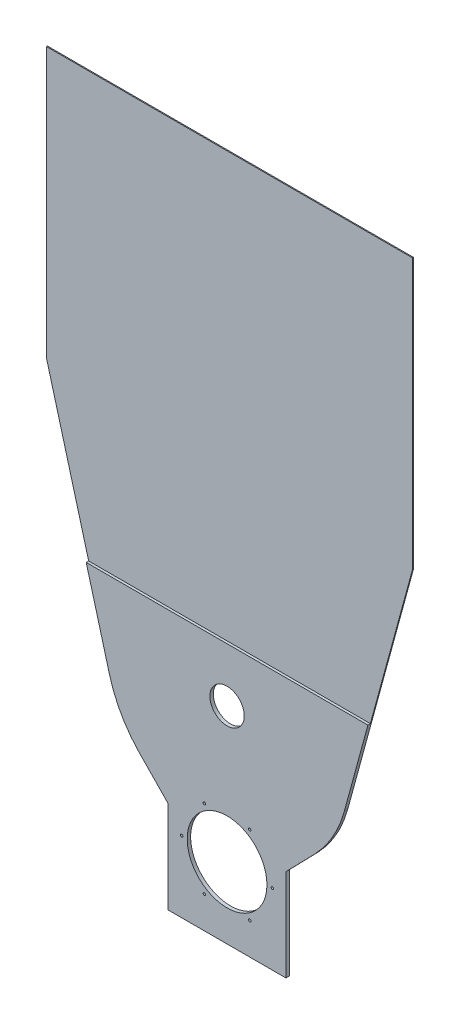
ISO-10303-21;
HEADER;
FILE_DESCRIPTION(('STEP AP214'),'2;1');
FILE_NAME('part.step','',(''),(''),'','','');
FILE_SCHEMA(('AUTOMOTIVE_DESIGN { 1 0 10303 214 1 1 1 1 }'));
ENDSEC;
DATA;
#1=APPLICATION_CONTEXT('core data for automotive mechanical design processes');
#2=APPLICATION_PROTOCOL_DEFINITION('international standard','automotive_design',2000,#1);
#3=PRODUCT_CONTEXT('',#1,'mechanical');
#4=PRODUCT('Part','Part','',(#3));
#5=PRODUCT_RELATED_PRODUCT_CATEGORY('part','',(#4));
#6=PRODUCT_DEFINITION_FORMATION('','',#4);
#7=PRODUCT_DEFINITION_CONTEXT('part definition',#1,'design');
#8=PRODUCT_DEFINITION('design','',#6,#7);
#9=PRODUCT_DEFINITION_SHAPE('','',#8);
#10=(LENGTH_UNIT() NAMED_UNIT(*) SI_UNIT(.MILLI.,.METRE.));
#11=(NAMED_UNIT(*) PLANE_ANGLE_UNIT() SI_UNIT($,.RADIAN.));
#12=(NAMED_UNIT(*) SI_UNIT($,.STERADIAN.) SOLID_ANGLE_UNIT());
#13=UNCERTAINTY_MEASURE_WITH_UNIT(LENGTH_MEASURE(1.E-05),#10,'distance_accuracy_value','');
#14=(GEOMETRIC_REPRESENTATION_CONTEXT(3) GLOBAL_UNCERTAINTY_ASSIGNED_CONTEXT((#13)) GLOBAL_UNIT_ASSIGNED_CONTEXT((#10,
#11,#12)) REPRESENTATION_CONTEXT('',''));
#15=CARTESIAN_POINT('',(0.,0.,0.));
#16=DIRECTION('',(0.,0.,1.));
#17=DIRECTION('',(1.,0.,0.));
#18=AXIS2_PLACEMENT_3D('',#15,#16,#17);
#19=CARTESIAN_POINT('',(0.,550.,14.));
#20=DIRECTION('',(0.,0.,1.));
#21=DIRECTION('',(1.,0.,0.));
#22=AXIS2_PLACEMENT_3D('',#19,#20,#21);
#23=PLANE('',#22);
#24=CARTESIAN_POINT('',(92.4999999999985,-160.214699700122,14.));
#25=DIRECTION('',(0.,0.,-1.));
#26=DIRECTION('',(-1.,0.,0.));
#27=AXIS2_PLACEMENT_3D('',#24,#25,#26);
#28=CIRCLE('',#27,5.09999999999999);
#29=CARTESIAN_POINT('',(87.3999999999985,-160.214699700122,14.));
#30=VERTEX_POINT('',#29);
#31=EDGE_CURVE('E269',#30,#30,#28,.T.);
#32=ORIENTED_EDGE('',*,*,#31,.T.);
#33=EDGE_LOOP('',(#32));
#34=FACE_BOUND('',#33,.T.);
#35=CARTESIAN_POINT('',(92.5000000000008,160.214699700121,14.));
#36=DIRECTION('',(0.,0.,-1.));
#37=DIRECTION('',(-1.,0.,0.));
#38=AXIS2_PLACEMENT_3D('',#35,#36,#37);
#39=CIRCLE('',#38,5.09999999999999);
#40=CARTESIAN_POINT('',(87.4000000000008,160.214699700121,14.));
#41=VERTEX_POINT('',#40);
#42=EDGE_CURVE('E257',#41,#41,#39,.T.);
#43=ORIENTED_EDGE('',*,*,#42,.T.);
#44=EDGE_LOOP('',(#43));
#45=FACE_BOUND('',#44,.T.);
#46=CARTESIAN_POINT('',(0.,550.,14.));
#47=DIRECTION('',(0.,0.,1.));
#48=DIRECTION('',(1.,0.,0.));
#49=AXIS2_PLACEMENT_3D('',#46,#47,#48);
#50=CIRCLE('',#49,70.);
#51=CARTESIAN_POINT('',(70.,550.,14.));
#52=VERTEX_POINT('',#51);
#53=EDGE_CURVE('E237',#52,#52,#50,.T.);
#54=ORIENTED_EDGE('',*,*,#53,.F.);
#55=EDGE_LOOP('',(#54));
#56=FACE_BOUND('',#55,.T.);
#57=CARTESIAN_POINT('',(0.,0.,14.));
#58=DIRECTION('',(0.,0.,1.));
#59=DIRECTION('',(1.,0.,0.));
#60=AXIS2_PLACEMENT_3D('',#57,#58,#59);
#61=CIRCLE('',#60,162.5);
#62=CARTESIAN_POINT('',(162.5,0.,14.));
#63=VERTEX_POINT('',#62);
#64=EDGE_CURVE('E161',#63,#63,#61,.T.);
#65=ORIENTED_EDGE('',*,*,#64,.F.);
#66=EDGE_LOOP('',(#65));
#67=FACE_BOUND('',#66,.T.);
#68=CARTESIAN_POINT('',(-185.,0.,14.));
#69=DIRECTION('',(0.,0.,-1.));
#70=DIRECTION('',(-1.,0.,0.));
#71=AXIS2_PLACEMENT_3D('',#68,#69,#70);
#72=CIRCLE('',#71,5.09999999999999);
#73=CARTESIAN_POINT('',(-190.1,0.,14.));
#74=VERTEX_POINT('',#73);
#75=EDGE_CURVE('E243',#74,#74,#72,.T.);
#76=ORIENTED_EDGE('',*,*,#75,.T.);
#77=EDGE_LOOP('',(#76));
#78=FACE_BOUND('',#77,.T.);
#79=CARTESIAN_POINT('',(-92.4999999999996,160.214699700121,14.));
#80=DIRECTION('',(0.,0.,-1.));
#81=DIRECTION('',(-1.,0.,0.));
#82=AXIS2_PLACEMENT_3D('',#79,#80,#81);
#83=CIRCLE('',#82,5.09999999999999);
#84=CARTESIAN_POINT('',(-97.5999999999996,160.214699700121,14.));
#85=VERTEX_POINT('',#84);
#86=EDGE_CURVE('E251',#85,#85,#83,.T.);
#87=ORIENTED_EDGE('',*,*,#86,.T.);
#88=EDGE_LOOP('',(#87));
#89=FACE_BOUND('',#88,.T.);
#90=CARTESIAN_POINT('',(185.,0.,14.));
#91=DIRECTION('',(0.,0.,-1.));
#92=DIRECTION('',(-1.,0.,0.));
#93=AXIS2_PLACEMENT_3D('',#90,#91,#92);
#94=CIRCLE('',#93,5.09999999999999);
#95=CARTESIAN_POINT('',(179.9,0.,14.));
#96=VERTEX_POINT('',#95);
#97=EDGE_CURVE('E263',#96,#96,#94,.T.);
#98=ORIENTED_EDGE('',*,*,#97,.T.);
#99=EDGE_LOOP('',(#98));
#100=FACE_BOUND('',#99,.T.);
#101=CARTESIAN_POINT('',(-92.5000000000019,-160.21469970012,14.));
#102=DIRECTION('',(0.,0.,-1.));
#103=DIRECTION('',(-1.,0.,0.));
#104=AXIS2_PLACEMENT_3D('',#101,#102,#103);
#105=CIRCLE('',#104,5.09999999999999);
#106=CARTESIAN_POINT('',(-97.6000000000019,-160.21469970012,14.));
#107=VERTEX_POINT('',#106);
#108=EDGE_CURVE('E275',#107,#107,#105,.T.);
#109=ORIENTED_EDGE('',*,*,#108,.T.);
#110=EDGE_LOOP('',(#109));
#111=FACE_BOUND('',#110,.T.);
#112=DIRECTION('',(0.263178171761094,0.964747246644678,0.));
#113=VECTOR('',#112,1.);
#114=CARTESIAN_POINT('',(746.,1400.,14.));
#115=LINE('',#114,#113);
#116=CARTESIAN_POINT('',(478.514634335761,419.463626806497,14.));
#117=VERTEX_POINT('',#116);
#118=CARTESIAN_POINT('',(574.139184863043,770.,14.));
#119=VERTEX_POINT('',#118);
#120=EDGE_CURVE('E139',#117,#119,#115,.T.);
#121=ORIENTED_EDGE('',*,*,#120,.T.);
#122=DIRECTION('',(-1.,0.,0.));
#123=VECTOR('',#122,1.);
#124=CARTESIAN_POINT('',(574.139184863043,770.,14.));
#125=LINE('',#124,#123);
#126=CARTESIAN_POINT('',(-574.139184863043,770.,14.));
#127=VERTEX_POINT('',#126);
#128=EDGE_CURVE('E136',#119,#127,#125,.T.);
#129=ORIENTED_EDGE('',*,*,#128,.T.);
#130=DIRECTION('',(0.263178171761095,-0.964747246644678,0.));
#131=VECTOR('',#130,1.);
#132=CARTESIAN_POINT('',(-746.000000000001,1400.,14.));
#133=LINE('',#132,#131);
#134=CARTESIAN_POINT('',(-478.514634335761,419.463626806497,14.));
#135=VERTEX_POINT('',#134);
#136=EDGE_CURVE('E129',#127,#135,#133,.T.);
#137=ORIENTED_EDGE('',*,*,#136,.T.);
#138=CARTESIAN_POINT('',(0.,550.,14.));
#139=DIRECTION('',(0.,0.,1.));
#140=DIRECTION('',(1.,0.,0.));
#141=AXIS2_PLACEMENT_3D('',#138,#139,#140);
#142=CIRCLE('',#141,496.);
#143=CARTESIAN_POINT('',(-359.378262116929,208.147305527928,14.));
#144=VERTEX_POINT('',#143);
#145=EDGE_CURVE('E133',#135,#144,#142,.T.);
#146=ORIENTED_EDGE('',*,*,#145,.T.);
#147=DIRECTION('',(0.697242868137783,-0.716834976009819,0.));
#148=VECTOR('',#147,1.);
#149=CARTESIAN_POINT('',(-240.,85.4145855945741,14.));
#150=LINE('',#149,#148);
#151=CARTESIAN_POINT('',(-240.,85.4145855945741,14.));
#152=VERTEX_POINT('',#151);
#153=EDGE_CURVE('E59',#144,#152,#150,.T.);
#154=ORIENTED_EDGE('',*,*,#153,.T.);
#155=DIRECTION('',(0.,-1.,0.));
#156=VECTOR('',#155,1.);
#157=CARTESIAN_POINT('',(-240.,-290.,14.));
#158=LINE('',#157,#156);
#159=CARTESIAN_POINT('',(-240.,-290.,14.));
#160=VERTEX_POINT('',#159);
#161=EDGE_CURVE('E185',#152,#160,#158,.T.);
#162=ORIENTED_EDGE('',*,*,#161,.T.);
#163=DIRECTION('',(1.,0.,0.));
#164=VECTOR('',#163,1.);
#165=CARTESIAN_POINT('',(-240.,-290.,14.));
#166=LINE('',#165,#164);
#167=CARTESIAN_POINT('',(240.,-290.,14.));
#168=VERTEX_POINT('',#167);
#169=EDGE_CURVE('E112',#160,#168,#166,.T.);
#170=ORIENTED_EDGE('',*,*,#169,.T.);
#171=DIRECTION('',(0.,1.,0.));
#172=VECTOR('',#171,1.);
#173=CARTESIAN_POINT('',(240.,-290.,14.));
#174=LINE('',#173,#172);
#175=CARTESIAN_POINT('',(240.,85.4145855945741,14.));
#176=VERTEX_POINT('',#175);
#177=EDGE_CURVE('E209',#168,#176,#174,.T.);
#178=ORIENTED_EDGE('',*,*,#177,.T.);
#179=DIRECTION('',(0.697242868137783,0.716834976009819,0.));
#180=VECTOR('',#179,1.);
#181=CARTESIAN_POINT('',(240.,85.4145855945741,14.));
#182=LINE('',#181,#180);
#183=CARTESIAN_POINT('',(359.378262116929,208.147305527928,14.));
#184=VERTEX_POINT('',#183);
#185=EDGE_CURVE('E227',#176,#184,#182,.T.);
#186=ORIENTED_EDGE('',*,*,#185,.T.);
#187=CARTESIAN_POINT('',(0.,550.,14.));
#188=DIRECTION('',(0.,0.,1.));
#189=DIRECTION('',(-1.,0.,0.));
#190=AXIS2_PLACEMENT_3D('',#187,#188,#189);
#191=CIRCLE('',#190,496.);
#192=EDGE_CURVE('E225',#184,#117,#191,.T.);
#193=ORIENTED_EDGE('',*,*,#192,.T.);
#194=EDGE_LOOP('',(#121,#129,#137,#146,#154,#162,#170,#178,#186,#193));
#195=FACE_BOUND('',#194,.T.);
#196=ADVANCED_FACE('F35',(#34,#45,#56,#67,#78,#89,#100,#111,#195),#23,.T.);
#197=CARTESIAN_POINT('',(746.,1400.,14.));
#198=DIRECTION('',(-0.964747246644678,0.263178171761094,0.));
#199=DIRECTION('',(-0.263178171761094,-0.964747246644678,0.));
#200=AXIS2_PLACEMENT_3D('',#197,#198,#199);
#201=PLANE('',#200);
#202=DIRECTION('',(0.,0.,1.));
#203=VECTOR('',#202,1.);
#204=CARTESIAN_POINT('',(574.139184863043,770.,4.));
#205=LINE('',#204,#203);
#206=CARTESIAN_POINT('',(574.139184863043,770.,4.));
#207=VERTEX_POINT('',#206);
#208=EDGE_CURVE('E281',#207,#119,#205,.T.);
#209=ORIENTED_EDGE('',*,*,#208,.T.);
#210=ORIENTED_EDGE('',*,*,#120,.F.);
#211=DIRECTION('',(0.,0.,-1.));
#212=VECTOR('',#211,1.);
#213=CARTESIAN_POINT('',(478.514634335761,419.463626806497,14.));
#214=LINE('',#213,#212);
#215=CARTESIAN_POINT('',(478.514634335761,419.463626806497,0.));
#216=VERTEX_POINT('',#215);
#217=EDGE_CURVE('E195',#117,#216,#214,.T.);
#218=ORIENTED_EDGE('',*,*,#217,.T.);
#219=DIRECTION('',(0.263178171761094,0.964747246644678,0.));
#220=VECTOR('',#219,1.);
#221=CARTESIAN_POINT('',(746.,1400.,0.));
#222=LINE('',#221,#220);
#223=CARTESIAN_POINT('',(746.,1400.,0.));
#224=VERTEX_POINT('',#223);
#225=EDGE_CURVE('E169',#216,#224,#222,.T.);
#226=ORIENTED_EDGE('',*,*,#225,.T.);
#227=DIRECTION('',(0.,0.,-1.));
#228=VECTOR('',#227,1.);
#229=CARTESIAN_POINT('',(746.,1400.,14.));
#230=LINE('',#229,#228);
#231=CARTESIAN_POINT('',(746.,1400.,4.));
#232=VERTEX_POINT('',#231);
#233=EDGE_CURVE('E193',#232,#224,#230,.T.);
#234=ORIENTED_EDGE('',*,*,#233,.F.);
#235=DIRECTION('',(-0.263178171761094,-0.964747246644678,0.));
#236=VECTOR('',#235,1.);
#237=CARTESIAN_POINT('',(574.139184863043,770.,4.));
#238=LINE('',#237,#236);
#239=EDGE_CURVE('E298',#232,#207,#238,.T.);
#240=ORIENTED_EDGE('',*,*,#239,.T.);
#241=EDGE_LOOP('',(#209,#210,#218,#226,#234,#240));
#242=FACE_BOUND('',#241,.T.);
#243=ADVANCED_FACE('F312',(#242),#201,.F.);
#244=CARTESIAN_POINT('',(746.,2500.,14.));
#245=DIRECTION('',(-1.,0.,0.));
#246=DIRECTION('',(0.,0.,1.));
#247=AXIS2_PLACEMENT_3D('',#244,#245,#246);
#248=PLANE('',#247);
#249=DIRECTION('',(0.,-1.,0.));
#250=VECTOR('',#249,1.);
#251=CARTESIAN_POINT('',(746.,1400.,4.));
#252=LINE('',#251,#250);
#253=CARTESIAN_POINT('',(746.,2500.,4.));
#254=VERTEX_POINT('',#253);
#255=EDGE_CURVE('E289',#254,#232,#252,.T.);
#256=ORIENTED_EDGE('',*,*,#255,.T.);
#257=ORIENTED_EDGE('',*,*,#233,.T.);
#258=DIRECTION('',(0.,1.,0.));
#259=VECTOR('',#258,1.);
#260=CARTESIAN_POINT('',(746.,2500.,0.));
#261=LINE('',#260,#259);
#262=CARTESIAN_POINT('',(746.,2500.,0.));
#263=VERTEX_POINT('',#262);
#264=EDGE_CURVE('E172',#224,#263,#261,.T.);
#265=ORIENTED_EDGE('',*,*,#264,.T.);
#266=DIRECTION('',(0.,0.,-1.));
#267=VECTOR('',#266,1.);
#268=CARTESIAN_POINT('',(746.,2500.,14.));
#269=LINE('',#268,#267);
#270=EDGE_CURVE('E191',#254,#263,#269,.T.);
#271=ORIENTED_EDGE('',*,*,#270,.F.);
#272=EDGE_LOOP('',(#256,#257,#265,#271));
#273=FACE_BOUND('',#272,.T.);
#274=ADVANCED_FACE('F307',(#273),#248,.F.);
#275=CARTESIAN_POINT('',(-746.,2500.,14.));
#276=DIRECTION('',(0.,-1.,0.));
#277=DIRECTION('',(0.,0.,-1.));
#278=AXIS2_PLACEMENT_3D('',#275,#276,#277);
#279=PLANE('',#278);
#280=DIRECTION('',(1.,0.,0.));
#281=VECTOR('',#280,1.);
#282=CARTESIAN_POINT('',(746.,2500.,4.));
#283=LINE('',#282,#281);
#284=CARTESIAN_POINT('',(-746.,2500.,4.));
#285=VERTEX_POINT('',#284);
#286=EDGE_CURVE('E287',#285,#254,#283,.T.);
#287=ORIENTED_EDGE('',*,*,#286,.T.);
#288=ORIENTED_EDGE('',*,*,#270,.T.);
#289=DIRECTION('',(-1.,0.,0.));
#290=VECTOR('',#289,1.);
#291=CARTESIAN_POINT('',(-746.,2500.,0.));
#292=LINE('',#291,#290);
#293=CARTESIAN_POINT('',(-746.,2500.,0.));
#294=VERTEX_POINT('',#293);
#295=EDGE_CURVE('E175',#263,#294,#292,.T.);
#296=ORIENTED_EDGE('',*,*,#295,.T.);
#297=DIRECTION('',(0.,0.,-1.));
#298=VECTOR('',#297,1.);
#299=CARTESIAN_POINT('',(-746.,2500.,14.));
#300=LINE('',#299,#298);
#301=EDGE_CURVE('E189',#285,#294,#300,.T.);
#302=ORIENTED_EDGE('',*,*,#301,.F.);
#303=EDGE_LOOP('',(#287,#288,#296,#302));
#304=FACE_BOUND('',#303,.T.);
#305=ADVANCED_FACE('F318',(#304),#279,.F.);
#306=CARTESIAN_POINT('',(-746.000000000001,1400.,14.));
#307=DIRECTION('',(1.,0.,0.));
#308=DIRECTION('',(0.,1.,0.));
#309=AXIS2_PLACEMENT_3D('',#306,#307,#308);
#310=PLANE('',#309);
#311=DIRECTION('',(0.,1.,0.));
#312=VECTOR('',#311,1.);
#313=CARTESIAN_POINT('',(-746.,2500.,4.));
#314=LINE('',#313,#312);
#315=CARTESIAN_POINT('',(-746.000000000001,1400.,4.));
#316=VERTEX_POINT('',#315);
#317=EDGE_CURVE('E50',#316,#285,#314,.T.);
#318=ORIENTED_EDGE('',*,*,#317,.T.);
#319=ORIENTED_EDGE('',*,*,#301,.T.);
#320=DIRECTION('',(0.,-1.,0.));
#321=VECTOR('',#320,1.);
#322=CARTESIAN_POINT('',(-746.000000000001,1400.,0.));
#323=LINE('',#322,#321);
#324=CARTESIAN_POINT('',(-746.000000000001,1400.,0.));
#325=VERTEX_POINT('',#324);
#326=EDGE_CURVE('E178',#294,#325,#323,.T.);
#327=ORIENTED_EDGE('',*,*,#326,.T.);
#328=DIRECTION('',(0.,0.,-1.));
#329=VECTOR('',#328,1.);
#330=CARTESIAN_POINT('',(-746.000000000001,1400.,14.));
#331=LINE('',#330,#329);
#332=EDGE_CURVE('E148',#316,#325,#331,.T.);
#333=ORIENTED_EDGE('',*,*,#332,.F.);
#334=EDGE_LOOP('',(#318,#319,#327,#333));
#335=FACE_BOUND('',#334,.T.);
#336=ADVANCED_FACE('F326',(#335),#310,.F.);
#337=CARTESIAN_POINT('',(-746.000000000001,1400.,14.));
#338=DIRECTION('',(0.964747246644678,0.263178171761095,0.));
#339=DIRECTION('',(-0.263178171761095,0.964747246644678,0.));
#340=AXIS2_PLACEMENT_3D('',#337,#338,#339);
#341=PLANE('',#340);
#342=DIRECTION('',(0.,0.,1.));
#343=VECTOR('',#342,1.);
#344=CARTESIAN_POINT('',(-574.139184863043,770.,4.));
#345=LINE('',#344,#343);
#346=CARTESIAN_POINT('',(-574.139184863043,770.,4.));
#347=VERTEX_POINT('',#346);
#348=EDGE_CURVE('E284',#347,#127,#345,.T.);
#349=ORIENTED_EDGE('',*,*,#348,.F.);
#350=DIRECTION('',(-0.263178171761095,0.964747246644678,0.));
#351=VECTOR('',#350,1.);
#352=CARTESIAN_POINT('',(-746.000000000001,1400.,4.));
#353=LINE('',#352,#351);
#354=EDGE_CURVE('E293',#347,#316,#353,.T.);
#355=ORIENTED_EDGE('',*,*,#354,.T.);
#356=ORIENTED_EDGE('',*,*,#332,.T.);
#357=DIRECTION('',(0.263178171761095,-0.964747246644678,0.));
#358=VECTOR('',#357,1.);
#359=CARTESIAN_POINT('',(-746.000000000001,1400.,0.));
#360=LINE('',#359,#358);
#361=CARTESIAN_POINT('',(-478.514634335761,419.463626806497,0.));
#362=VERTEX_POINT('',#361);
#363=EDGE_CURVE('E145',#325,#362,#360,.T.);
#364=ORIENTED_EDGE('',*,*,#363,.T.);
#365=DIRECTION('',(0.,0.,-1.));
#366=VECTOR('',#365,1.);
#367=CARTESIAN_POINT('',(-478.514634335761,419.463626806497,14.));
#368=LINE('',#367,#366);
#369=EDGE_CURVE('E142',#135,#362,#368,.T.);
#370=ORIENTED_EDGE('',*,*,#369,.F.);
#371=ORIENTED_EDGE('',*,*,#136,.F.);
#372=EDGE_LOOP('',(#349,#355,#356,#364,#370,#371));
#373=FACE_BOUND('',#372,.T.);
#374=ADVANCED_FACE('F143',(#373),#341,.F.);
#375=CARTESIAN_POINT('',(0.,550.,0.));
#376=DIRECTION('',(0.,0.,1.));
#377=DIRECTION('',(1.,0.,0.));
#378=AXIS2_PLACEMENT_3D('',#375,#376,#377);
#379=PLANE('',#378);
#380=CARTESIAN_POINT('',(-185.,0.,0.));
#381=DIRECTION('',(0.,0.,-1.));
#382=DIRECTION('',(-1.,0.,0.));
#383=AXIS2_PLACEMENT_3D('',#380,#381,#382);
#384=CIRCLE('',#383,5.09999999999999);
#385=CARTESIAN_POINT('',(-190.1,0.,0.));
#386=VERTEX_POINT('',#385);
#387=EDGE_CURVE('E248',#386,#386,#384,.T.);
#388=ORIENTED_EDGE('',*,*,#387,.F.);
#389=EDGE_LOOP('',(#388));
#390=FACE_BOUND('',#389,.T.);
#391=DIRECTION('',(0.,-1.,0.));
#392=VECTOR('',#391,1.);
#393=CARTESIAN_POINT('',(-240.,-290.,0.));
#394=LINE('',#393,#392);
#395=CARTESIAN_POINT('',(-240.,85.4145855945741,0.));
#396=VERTEX_POINT('',#395);
#397=CARTESIAN_POINT('',(-240.,-290.,0.));
#398=VERTEX_POINT('',#397);
#399=EDGE_CURVE('E157',#396,#398,#394,.T.);
#400=ORIENTED_EDGE('',*,*,#399,.F.);
#401=DIRECTION('',(0.697242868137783,-0.716834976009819,0.));
#402=VECTOR('',#401,1.);
#403=CARTESIAN_POINT('',(-240.,85.4145855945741,0.));
#404=LINE('',#403,#402);
#405=CARTESIAN_POINT('',(-359.378262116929,208.147305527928,0.));
#406=VERTEX_POINT('',#405);
#407=EDGE_CURVE('E104',#406,#396,#404,.T.);
#408=ORIENTED_EDGE('',*,*,#407,.F.);
#409=CARTESIAN_POINT('',(0.,550.,0.));
#410=DIRECTION('',(0.,0.,1.));
#411=DIRECTION('',(1.,0.,0.));
#412=AXIS2_PLACEMENT_3D('',#409,#410,#411);
#413=CIRCLE('',#412,496.);
#414=EDGE_CURVE('E182',#362,#406,#413,.T.);
#415=ORIENTED_EDGE('',*,*,#414,.F.);
#416=ORIENTED_EDGE('',*,*,#363,.F.);
#417=ORIENTED_EDGE('',*,*,#326,.F.);
#418=ORIENTED_EDGE('',*,*,#295,.F.);
#419=ORIENTED_EDGE('',*,*,#264,.F.);
#420=ORIENTED_EDGE('',*,*,#225,.F.);
#421=CARTESIAN_POINT('',(0.,550.,0.));
#422=DIRECTION('',(0.,0.,1.));
#423=DIRECTION('',(-1.,0.,0.));
#424=AXIS2_PLACEMENT_3D('',#421,#422,#423);
#425=CIRCLE('',#424,496.);
#426=CARTESIAN_POINT('',(359.378262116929,208.147305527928,0.));
#427=VERTEX_POINT('',#426);
#428=EDGE_CURVE('E167',#427,#216,#425,.T.);
#429=ORIENTED_EDGE('',*,*,#428,.F.);
#430=DIRECTION('',(0.697242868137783,0.716834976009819,0.));
#431=VECTOR('',#430,1.);
#432=CARTESIAN_POINT('',(240.,85.4145855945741,0.));
#433=LINE('',#432,#431);
#434=CARTESIAN_POINT('',(240.,85.4145855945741,0.));
#435=VERTEX_POINT('',#434);
#436=EDGE_CURVE('E165',#435,#427,#433,.T.);
#437=ORIENTED_EDGE('',*,*,#436,.F.);
#438=DIRECTION('',(0.,1.,0.));
#439=VECTOR('',#438,1.);
#440=CARTESIAN_POINT('',(240.,-290.,0.));
#441=LINE('',#440,#439);
#442=CARTESIAN_POINT('',(240.,-290.,0.));
#443=VERTEX_POINT('',#442);
#444=EDGE_CURVE('E163',#443,#435,#441,.T.);
#445=ORIENTED_EDGE('',*,*,#444,.F.);
#446=DIRECTION('',(1.,0.,0.));
#447=VECTOR('',#446,1.);
#448=CARTESIAN_POINT('',(-240.,-290.,0.));
#449=LINE('',#448,#447);
#450=EDGE_CURVE('E160',#398,#443,#449,.T.);
#451=ORIENTED_EDGE('',*,*,#450,.F.);
#452=EDGE_LOOP('',(#400,#408,#415,#416,#417,#418,#419,#420,#429,#437,#445,#451));
#453=FACE_BOUND('',#452,.T.);
#454=CARTESIAN_POINT('',(0.,0.,0.));
#455=DIRECTION('',(0.,0.,1.));
#456=DIRECTION('',(1.,0.,0.));
#457=AXIS2_PLACEMENT_3D('',#454,#455,#456);
#458=CIRCLE('',#457,162.5);
#459=CARTESIAN_POINT('',(162.5,0.,0.));
#460=VERTEX_POINT('',#459);
#461=EDGE_CURVE('E234',#460,#460,#458,.T.);
#462=ORIENTED_EDGE('',*,*,#461,.T.);
#463=EDGE_LOOP('',(#462));
#464=FACE_BOUND('',#463,.T.);
#465=CARTESIAN_POINT('',(0.,550.,0.));
#466=DIRECTION('',(0.,0.,1.));
#467=DIRECTION('',(1.,0.,0.));
#468=AXIS2_PLACEMENT_3D('',#465,#466,#467);
#469=CIRCLE('',#468,70.);
#470=CARTESIAN_POINT('',(70.,550.,0.));
#471=VERTEX_POINT('',#470);
#472=EDGE_CURVE('E240',#471,#471,#469,.T.);
#473=ORIENTED_EDGE('',*,*,#472,.T.);
#474=EDGE_LOOP('',(#473));
#475=FACE_BOUND('',#474,.T.);
#476=CARTESIAN_POINT('',(-92.4999999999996,160.214699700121,0.));
#477=DIRECTION('',(0.,0.,-1.));
#478=DIRECTION('',(-1.,0.,0.));
#479=AXIS2_PLACEMENT_3D('',#476,#477,#478);
#480=CIRCLE('',#479,5.09999999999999);
#481=CARTESIAN_POINT('',(-97.5999999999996,160.214699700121,0.));
#482=VERTEX_POINT('',#481);
#483=EDGE_CURVE('E254',#482,#482,#480,.T.);
#484=ORIENTED_EDGE('',*,*,#483,.F.);
#485=EDGE_LOOP('',(#484));
#486=FACE_BOUND('',#485,.T.);
#487=CARTESIAN_POINT('',(92.5000000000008,160.214699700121,0.));
#488=DIRECTION('',(0.,0.,-1.));
#489=DIRECTION('',(-1.,0.,0.));
#490=AXIS2_PLACEMENT_3D('',#487,#488,#489);
#491=CIRCLE('',#490,5.09999999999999);
#492=CARTESIAN_POINT('',(87.4000000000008,160.214699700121,0.));
#493=VERTEX_POINT('',#492);
#494=EDGE_CURVE('E260',#493,#493,#491,.T.);
#495=ORIENTED_EDGE('',*,*,#494,.F.);
#496=EDGE_LOOP('',(#495));
#497=FACE_BOUND('',#496,.T.);
#498=CARTESIAN_POINT('',(185.,0.,0.));
#499=DIRECTION('',(0.,0.,-1.));
#500=DIRECTION('',(-1.,0.,0.));
#501=AXIS2_PLACEMENT_3D('',#498,#499,#500);
#502=CIRCLE('',#501,5.09999999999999);
#503=CARTESIAN_POINT('',(179.9,0.,0.));
#504=VERTEX_POINT('',#503);
#505=EDGE_CURVE('E266',#504,#504,#502,.T.);
#506=ORIENTED_EDGE('',*,*,#505,.F.);
#507=EDGE_LOOP('',(#506));
#508=FACE_BOUND('',#507,.T.);
#509=CARTESIAN_POINT('',(92.4999999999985,-160.214699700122,0.));
#510=DIRECTION('',(0.,0.,-1.));
#511=DIRECTION('',(-1.,0.,0.));
#512=AXIS2_PLACEMENT_3D('',#509,#510,#511);
#513=CIRCLE('',#512,5.09999999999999);
#514=CARTESIAN_POINT('',(87.3999999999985,-160.214699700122,0.));
#515=VERTEX_POINT('',#514);
#516=EDGE_CURVE('E272',#515,#515,#513,.T.);
#517=ORIENTED_EDGE('',*,*,#516,.F.);
#518=EDGE_LOOP('',(#517));
#519=FACE_BOUND('',#518,.T.);
#520=CARTESIAN_POINT('',(-92.5000000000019,-160.21469970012,0.));
#521=DIRECTION('',(0.,0.,-1.));
#522=DIRECTION('',(-1.,0.,0.));
#523=AXIS2_PLACEMENT_3D('',#520,#521,#522);
#524=CIRCLE('',#523,5.09999999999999);
#525=CARTESIAN_POINT('',(-97.6000000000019,-160.21469970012,0.));
#526=VERTEX_POINT('',#525);
#527=EDGE_CURVE('E278',#526,#526,#524,.T.);
#528=ORIENTED_EDGE('',*,*,#527,.F.);
#529=EDGE_LOOP('',(#528));
#530=FACE_BOUND('',#529,.T.);
#531=ADVANCED_FACE('F213',(#390,#453,#464,#475,#486,#497,#508,#519,#530),#379,.F.);
#532=CARTESIAN_POINT('',(-240.,-290.,14.));
#533=DIRECTION('',(1.,0.,0.));
#534=DIRECTION('',(0.,1.,0.));
#535=AXIS2_PLACEMENT_3D('',#532,#533,#534);
#536=PLANE('',#535);
#537=ORIENTED_EDGE('',*,*,#399,.T.);
#538=DIRECTION('',(0.,0.,-1.));
#539=VECTOR('',#538,1.);
#540=CARTESIAN_POINT('',(-240.,-290.,14.));
#541=LINE('',#540,#539);
#542=EDGE_CURVE('E11',#160,#398,#541,.T.);
#543=ORIENTED_EDGE('',*,*,#542,.F.);
#544=ORIENTED_EDGE('',*,*,#161,.F.);
#545=DIRECTION('',(0.,0.,-1.));
#546=VECTOR('',#545,1.);
#547=CARTESIAN_POINT('',(-240.,85.4145855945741,14.));
#548=LINE('',#547,#546);
#549=EDGE_CURVE('E153',#152,#396,#548,.T.);
#550=ORIENTED_EDGE('',*,*,#549,.T.);
#551=EDGE_LOOP('',(#537,#543,#544,#550));
#552=FACE_BOUND('',#551,.T.);
#553=ADVANCED_FACE('F37',(#552),#536,.F.);
#554=CARTESIAN_POINT('',(-240.,-290.,14.));
#555=DIRECTION('',(0.,1.,0.));
#556=DIRECTION('',(-1.,0.,0.));
#557=AXIS2_PLACEMENT_3D('',#554,#555,#556);
#558=PLANE('',#557);
#559=ORIENTED_EDGE('',*,*,#450,.T.);
#560=DIRECTION('',(0.,0.,-1.));
#561=VECTOR('',#560,1.);
#562=CARTESIAN_POINT('',(240.,-290.,14.));
#563=LINE('',#562,#561);
#564=EDGE_CURVE('E43',#168,#443,#563,.T.);
#565=ORIENTED_EDGE('',*,*,#564,.F.);
#566=ORIENTED_EDGE('',*,*,#169,.F.);
#567=ORIENTED_EDGE('',*,*,#542,.T.);
#568=EDGE_LOOP('',(#559,#565,#566,#567));
#569=FACE_BOUND('',#568,.T.);
#570=ADVANCED_FACE('F378',(#569),#558,.F.);
#571=CARTESIAN_POINT('',(240.,-290.,14.));
#572=DIRECTION('',(-1.,0.,0.));
#573=DIRECTION('',(0.,-1.,0.));
#574=AXIS2_PLACEMENT_3D('',#571,#572,#573);
#575=PLANE('',#574);
#576=ORIENTED_EDGE('',*,*,#444,.T.);
#577=DIRECTION('',(0.,0.,-1.));
#578=VECTOR('',#577,1.);
#579=CARTESIAN_POINT('',(240.,85.4145855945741,14.));
#580=LINE('',#579,#578);
#581=EDGE_CURVE('E201',#176,#435,#580,.T.);
#582=ORIENTED_EDGE('',*,*,#581,.F.);
#583=ORIENTED_EDGE('',*,*,#177,.F.);
#584=ORIENTED_EDGE('',*,*,#564,.T.);
#585=EDGE_LOOP('',(#576,#582,#583,#584));
#586=FACE_BOUND('',#585,.T.);
#587=ADVANCED_FACE('F207',(#586),#575,.F.);
#588=CARTESIAN_POINT('',(240.,85.4145855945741,14.));
#589=DIRECTION('',(-0.716834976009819,0.697242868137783,0.));
#590=DIRECTION('',(-0.697242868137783,-0.716834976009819,0.));
#591=AXIS2_PLACEMENT_3D('',#588,#589,#590);
#592=PLANE('',#591);
#593=ORIENTED_EDGE('',*,*,#436,.T.);
#594=DIRECTION('',(0.,0.,-1.));
#595=VECTOR('',#594,1.);
#596=CARTESIAN_POINT('',(359.378262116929,208.147305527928,14.));
#597=LINE('',#596,#595);
#598=EDGE_CURVE('E198',#184,#427,#597,.T.);
#599=ORIENTED_EDGE('',*,*,#598,.F.);
#600=ORIENTED_EDGE('',*,*,#185,.F.);
#601=ORIENTED_EDGE('',*,*,#581,.T.);
#602=EDGE_LOOP('',(#593,#599,#600,#601));
#603=FACE_BOUND('',#602,.T.);
#604=ADVANCED_FACE('F219',(#603),#592,.F.);
#605=CARTESIAN_POINT('',(0.,550.,14.));
#606=DIRECTION('',(0.,0.,-1.));
#607=DIRECTION('',(-1.,0.,0.));
#608=AXIS2_PLACEMENT_3D('',#605,#606,#607);
#609=CYLINDRICAL_SURFACE('',#608,496.);
#610=ORIENTED_EDGE('',*,*,#428,.T.);
#611=ORIENTED_EDGE('',*,*,#217,.F.);
#612=ORIENTED_EDGE('',*,*,#192,.F.);
#613=ORIENTED_EDGE('',*,*,#598,.T.);
#614=EDGE_LOOP('',(#610,#611,#612,#613));
#615=FACE_BOUND('',#614,.T.);
#616=ADVANCED_FACE('F223',(#615),#609,.T.);
#617=CARTESIAN_POINT('',(0.,550.,14.));
#618=DIRECTION('',(0.,0.,-1.));
#619=DIRECTION('',(-1.,0.,0.));
#620=AXIS2_PLACEMENT_3D('',#617,#618,#619);
#621=CYLINDRICAL_SURFACE('',#620,496.);
#622=ORIENTED_EDGE('',*,*,#414,.T.);
#623=DIRECTION('',(0.,0.,-1.));
#624=VECTOR('',#623,1.);
#625=CARTESIAN_POINT('',(-359.378262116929,208.147305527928,14.));
#626=LINE('',#625,#624);
#627=EDGE_CURVE('E149',#144,#406,#626,.T.);
#628=ORIENTED_EDGE('',*,*,#627,.F.);
#629=ORIENTED_EDGE('',*,*,#145,.F.);
#630=ORIENTED_EDGE('',*,*,#369,.T.);
#631=EDGE_LOOP('',(#622,#628,#629,#630));
#632=FACE_BOUND('',#631,.T.);
#633=ADVANCED_FACE('F151',(#632),#621,.T.);
#634=CARTESIAN_POINT('',(-240.,85.4145855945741,14.));
#635=DIRECTION('',(0.716834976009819,0.697242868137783,0.));
#636=DIRECTION('',(-0.697242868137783,0.716834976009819,0.));
#637=AXIS2_PLACEMENT_3D('',#634,#635,#636);
#638=PLANE('',#637);
#639=ORIENTED_EDGE('',*,*,#407,.T.);
#640=ORIENTED_EDGE('',*,*,#549,.F.);
#641=ORIENTED_EDGE('',*,*,#153,.F.);
#642=ORIENTED_EDGE('',*,*,#627,.T.);
#643=EDGE_LOOP('',(#639,#640,#641,#642));
#644=FACE_BOUND('',#643,.T.);
#645=ADVANCED_FACE('F360',(#644),#638,.F.);
#646=CARTESIAN_POINT('',(0.,0.,14.));
#647=DIRECTION('',(0.,0.,-1.));
#648=DIRECTION('',(-1.,0.,0.));
#649=AXIS2_PLACEMENT_3D('',#646,#647,#648);
#650=CYLINDRICAL_SURFACE('',#649,162.5);
#651=ORIENTED_EDGE('',*,*,#64,.T.);
#652=EDGE_LOOP('',(#651));
#653=FACE_BOUND('',#652,.T.);
#654=ORIENTED_EDGE('',*,*,#461,.F.);
#655=EDGE_LOOP('',(#654));
#656=FACE_BOUND('',#655,.T.);
#657=ADVANCED_FACE('F355',(#653,#656),#650,.F.);
#658=CARTESIAN_POINT('',(0.,550.,14.));
#659=DIRECTION('',(0.,0.,-1.));
#660=DIRECTION('',(-1.,0.,0.));
#661=AXIS2_PLACEMENT_3D('',#658,#659,#660);
#662=CYLINDRICAL_SURFACE('',#661,70.);
#663=ORIENTED_EDGE('',*,*,#53,.T.);
#664=EDGE_LOOP('',(#663));
#665=FACE_BOUND('',#664,.T.);
#666=ORIENTED_EDGE('',*,*,#472,.F.);
#667=EDGE_LOOP('',(#666));
#668=FACE_BOUND('',#667,.T.);
#669=ADVANCED_FACE('F477',(#665,#668),#662,.F.);
#670=CARTESIAN_POINT('',(-185.,0.,0.));
#671=DIRECTION('',(0.,0.,-1.));
#672=DIRECTION('',(-1.,0.,0.));
#673=AXIS2_PLACEMENT_3D('',#670,#671,#672);
#674=CYLINDRICAL_SURFACE('',#673,5.09999999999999);
#675=ORIENTED_EDGE('',*,*,#75,.F.);
#676=EDGE_LOOP('',(#675));
#677=FACE_BOUND('',#676,.T.);
#678=ORIENTED_EDGE('',*,*,#387,.T.);
#679=EDGE_LOOP('',(#678));
#680=FACE_BOUND('',#679,.T.);
#681=ADVANCED_FACE('F467',(#677,#680),#674,.F.);
#682=CARTESIAN_POINT('',(-92.4999999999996,160.214699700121,0.));
#683=DIRECTION('',(0.,0.,-1.));
#684=DIRECTION('',(-1.,0.,0.));
#685=AXIS2_PLACEMENT_3D('',#682,#683,#684);
#686=CYLINDRICAL_SURFACE('',#685,5.09999999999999);
#687=ORIENTED_EDGE('',*,*,#86,.F.);
#688=EDGE_LOOP('',(#687));
#689=FACE_BOUND('',#688,.T.);
#690=ORIENTED_EDGE('',*,*,#483,.T.);
#691=EDGE_LOOP('',(#690));
#692=FACE_BOUND('',#691,.T.);
#693=ADVANCED_FACE('F458',(#689,#692),#686,.F.);
#694=CARTESIAN_POINT('',(92.5000000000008,160.214699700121,0.));
#695=DIRECTION('',(0.,0.,-1.));
#696=DIRECTION('',(-1.,0.,0.));
#697=AXIS2_PLACEMENT_3D('',#694,#695,#696);
#698=CYLINDRICAL_SURFACE('',#697,5.09999999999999);
#699=ORIENTED_EDGE('',*,*,#42,.F.);
#700=EDGE_LOOP('',(#699));
#701=FACE_BOUND('',#700,.T.);
#702=ORIENTED_EDGE('',*,*,#494,.T.);
#703=EDGE_LOOP('',(#702));
#704=FACE_BOUND('',#703,.T.);
#705=ADVANCED_FACE('F448',(#701,#704),#698,.F.);
#706=CARTESIAN_POINT('',(185.,0.,0.));
#707=DIRECTION('',(0.,0.,-1.));
#708=DIRECTION('',(-1.,0.,0.));
#709=AXIS2_PLACEMENT_3D('',#706,#707,#708);
#710=CYLINDRICAL_SURFACE('',#709,5.09999999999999);
#711=ORIENTED_EDGE('',*,*,#97,.F.);
#712=EDGE_LOOP('',(#711));
#713=FACE_BOUND('',#712,.T.);
#714=ORIENTED_EDGE('',*,*,#505,.T.);
#715=EDGE_LOOP('',(#714));
#716=FACE_BOUND('',#715,.T.);
#717=ADVANCED_FACE('F438',(#713,#716),#710,.F.);
#718=CARTESIAN_POINT('',(92.4999999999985,-160.214699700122,0.));
#719=DIRECTION('',(0.,0.,-1.));
#720=DIRECTION('',(-1.,0.,0.));
#721=AXIS2_PLACEMENT_3D('',#718,#719,#720);
#722=CYLINDRICAL_SURFACE('',#721,5.09999999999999);
#723=ORIENTED_EDGE('',*,*,#31,.F.);
#724=EDGE_LOOP('',(#723));
#725=FACE_BOUND('',#724,.T.);
#726=ORIENTED_EDGE('',*,*,#516,.T.);
#727=EDGE_LOOP('',(#726));
#728=FACE_BOUND('',#727,.T.);
#729=ADVANCED_FACE('F342',(#725,#728),#722,.F.);
#730=CARTESIAN_POINT('',(-92.5000000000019,-160.21469970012,0.));
#731=DIRECTION('',(0.,0.,-1.));
#732=DIRECTION('',(-1.,0.,0.));
#733=AXIS2_PLACEMENT_3D('',#730,#731,#732);
#734=CYLINDRICAL_SURFACE('',#733,5.09999999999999);
#735=ORIENTED_EDGE('',*,*,#108,.F.);
#736=EDGE_LOOP('',(#735));
#737=FACE_BOUND('',#736,.T.);
#738=ORIENTED_EDGE('',*,*,#527,.T.);
#739=EDGE_LOOP('',(#738));
#740=FACE_BOUND('',#739,.T.);
#741=ADVANCED_FACE('F335',(#737,#740),#734,.F.);
#742=CARTESIAN_POINT('',(574.139184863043,770.,4.));
#743=DIRECTION('',(0.,1.,0.));
#744=DIRECTION('',(0.,0.,1.));
#745=AXIS2_PLACEMENT_3D('',#742,#743,#744);
#746=PLANE('',#745);
#747=ORIENTED_EDGE('',*,*,#128,.F.);
#748=ORIENTED_EDGE('',*,*,#208,.F.);
#749=DIRECTION('',(-1.,0.,0.));
#750=VECTOR('',#749,1.);
#751=CARTESIAN_POINT('',(574.139184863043,770.,4.));
#752=LINE('',#751,#750);
#753=EDGE_CURVE('E295',#207,#347,#752,.T.);
#754=ORIENTED_EDGE('',*,*,#753,.T.);
#755=ORIENTED_EDGE('',*,*,#348,.T.);
#756=EDGE_LOOP('',(#747,#748,#754,#755));
#757=FACE_BOUND('',#756,.T.);
#758=ADVANCED_FACE('F333',(#757),#746,.T.);
#759=CARTESIAN_POINT('',(0.,0.,4.));
#760=DIRECTION('',(0.,0.,1.));
#761=DIRECTION('',(1.,0.,0.));
#762=AXIS2_PLACEMENT_3D('',#759,#760,#761);
#763=PLANE('',#762);
#764=ORIENTED_EDGE('',*,*,#255,.F.);
#765=ORIENTED_EDGE('',*,*,#286,.F.);
#766=ORIENTED_EDGE('',*,*,#317,.F.);
#767=ORIENTED_EDGE('',*,*,#354,.F.);
#768=ORIENTED_EDGE('',*,*,#753,.F.);
#769=ORIENTED_EDGE('',*,*,#239,.F.);
#770=EDGE_LOOP('',(#764,#765,#766,#767,#768,#769));
#771=FACE_BOUND('',#770,.T.);
#772=ADVANCED_FACE('F321',(#771),#763,.T.);
#773=CLOSED_SHELL('',(#196,#243,#274,#305,#336,#374,#531,#553,#570,#587,#604,#616,#633,#645,
#657,#669,#681,#693,#705,#717,#729,#741,#758,#772));
#774=MANIFOLD_SOLID_BREP('B2',#773);
#775=ADVANCED_BREP_SHAPE_REPRESENTATION('',(#18,#774),#14);
#776=SHAPE_DEFINITION_REPRESENTATION(#9,#775);
ENDSEC;
END-ISO-10303-21;
